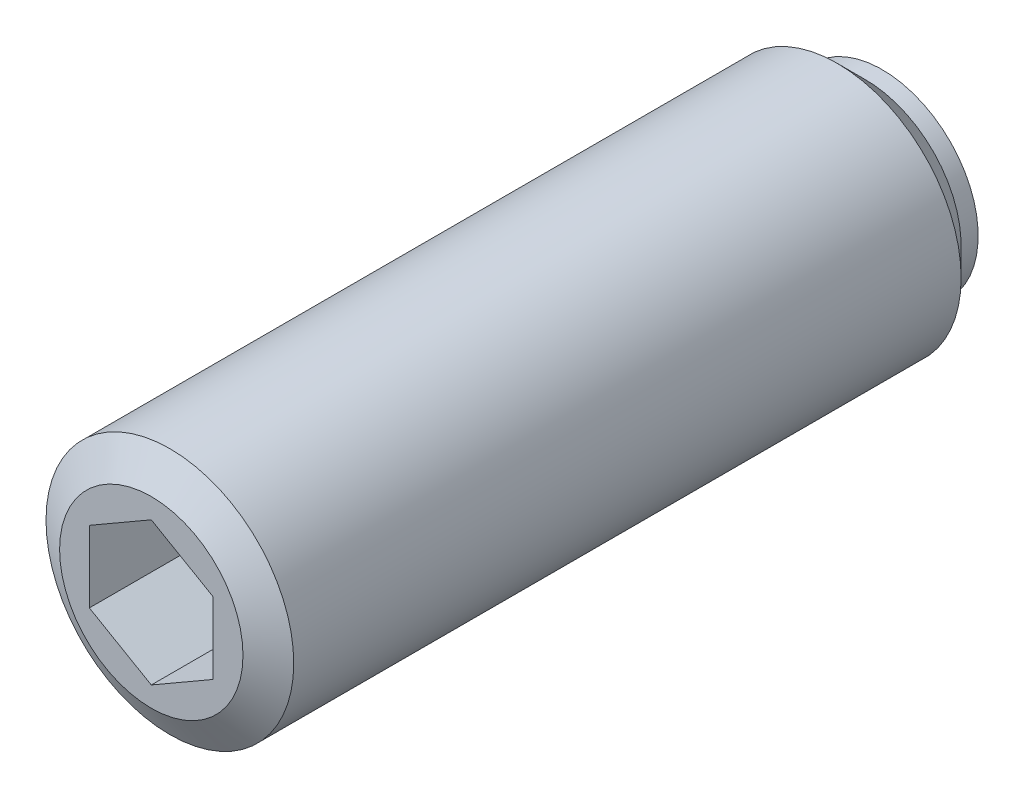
ISO-10303-21;
HEADER;
FILE_DESCRIPTION(('STEP AP214'),'2;1');
FILE_NAME('part.step','',(''),(''),'','','');
FILE_SCHEMA(('AUTOMOTIVE_DESIGN { 1 0 10303 214 1 1 1 1 }'));
ENDSEC;
DATA;
#1=APPLICATION_CONTEXT('core data for automotive mechanical design processes');
#2=APPLICATION_PROTOCOL_DEFINITION('international standard','automotive_design',2000,#1);
#3=PRODUCT_CONTEXT('',#1,'mechanical');
#4=PRODUCT('Part','Part','',(#3));
#5=PRODUCT_RELATED_PRODUCT_CATEGORY('part','',(#4));
#6=PRODUCT_DEFINITION_FORMATION('','',#4);
#7=PRODUCT_DEFINITION_CONTEXT('part definition',#1,'design');
#8=PRODUCT_DEFINITION('design','',#6,#7);
#9=PRODUCT_DEFINITION_SHAPE('','',#8);
#10=(LENGTH_UNIT() NAMED_UNIT(*) SI_UNIT(.MILLI.,.METRE.));
#11=(NAMED_UNIT(*) PLANE_ANGLE_UNIT() SI_UNIT($,.RADIAN.));
#12=(NAMED_UNIT(*) SI_UNIT($,.STERADIAN.) SOLID_ANGLE_UNIT());
#13=UNCERTAINTY_MEASURE_WITH_UNIT(LENGTH_MEASURE(1.E-05),#10,'distance_accuracy_value','');
#14=(GEOMETRIC_REPRESENTATION_CONTEXT(3) GLOBAL_UNCERTAINTY_ASSIGNED_CONTEXT((#13)) GLOBAL_UNIT_ASSIGNED_CONTEXT((#10,
#11,#12)) REPRESENTATION_CONTEXT('',''));
#15=CARTESIAN_POINT('',(0.,0.,0.));
#16=DIRECTION('',(0.,0.,1.));
#17=DIRECTION('',(1.,0.,0.));
#18=AXIS2_PLACEMENT_3D('',#15,#16,#17);
#19=CARTESIAN_POINT('',(0.,0.,2.75));
#20=DIRECTION('',(0.,0.,1.));
#21=DIRECTION('',(0.,-1.,0.));
#22=AXIS2_PLACEMENT_3D('',#19,#20,#21);
#23=SPHERICAL_SURFACE('',#22,2.75);
#24=CARTESIAN_POINT('',(0.,0.,1.4));
#25=DIRECTION('',(0.,0.,1.));
#26=DIRECTION('',(-1.,0.,0.));
#27=AXIS2_PLACEMENT_3D('',#24,#25,#26);
#28=CIRCLE('',#27,2.39582971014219);
#29=CARTESIAN_POINT('',(-2.39582971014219,0.,1.4));
#30=VERTEX_POINT('',#29);
#31=EDGE_CURVE('E9',#30,#30,#28,.T.);
#32=ORIENTED_EDGE('',*,*,#31,.F.);
#33=EDGE_LOOP('',(#32));
#34=FACE_BOUND('',#33,.T.);
#35=ADVANCED_FACE('F14',(#34),#23,.T.);
#36=CARTESIAN_POINT('',(0.,3.1,1.4));
#37=DIRECTION('',(0.,0.,1.));
#38=DIRECTION('',(-1.,0.,0.));
#39=AXIS2_PLACEMENT_3D('',#36,#37,#38);
#40=PLANE('',#39);
#41=CARTESIAN_POINT('',(0.,0.,1.4));
#42=DIRECTION('',(0.,0.,1.));
#43=DIRECTION('',(-1.,0.,0.));
#44=AXIS2_PLACEMENT_3D('',#41,#42,#43);
#45=CIRCLE('',#44,3.1);
#46=CARTESIAN_POINT('',(-3.1,0.,1.4));
#47=VERTEX_POINT('',#46);
#48=EDGE_CURVE('E21',#47,#47,#45,.T.);
#49=ORIENTED_EDGE('',*,*,#48,.F.);
#50=EDGE_LOOP('',(#49));
#51=FACE_BOUND('',#50,.T.);
#52=ORIENTED_EDGE('',*,*,#31,.T.);
#53=EDGE_LOOP('',(#52));
#54=FACE_BOUND('',#53,.T.);
#55=ADVANCED_FACE('F138',(#51,#54),#40,.F.);
#56=CARTESIAN_POINT('',(0.,0.,26.3950749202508));
#57=DIRECTION('',(0.,0.,1.));
#58=DIRECTION('',(-1.,0.,0.));
#59=AXIS2_PLACEMENT_3D('',#56,#57,#58);
#60=CYLINDRICAL_SURFACE('',#59,3.1);
#61=CARTESIAN_POINT('',(0.,0.,1.95));
#62=DIRECTION('',(0.,0.,1.));
#63=DIRECTION('',(-1.,0.,0.));
#64=AXIS2_PLACEMENT_3D('',#61,#62,#63);
#65=CIRCLE('',#64,3.1);
#66=CARTESIAN_POINT('',(-3.1,0.,1.95));
#67=VERTEX_POINT('',#66);
#68=EDGE_CURVE('E131',#67,#67,#65,.T.);
#69=ORIENTED_EDGE('',*,*,#68,.F.);
#70=EDGE_LOOP('',(#69));
#71=FACE_BOUND('',#70,.T.);
#72=ORIENTED_EDGE('',*,*,#48,.T.);
#73=EDGE_LOOP('',(#72));
#74=FACE_BOUND('',#73,.T.);
#75=ADVANCED_FACE('F136',(#71,#74),#60,.T.);
#76=CARTESIAN_POINT('',(0.,0.,1.95));
#77=DIRECTION('',(0.,0.,1.));
#78=DIRECTION('',(-1.,0.,0.));
#79=AXIS2_PLACEMENT_3D('',#76,#77,#78);
#80=CONICAL_SURFACE('',#79,3.1,0.785398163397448);
#81=CARTESIAN_POINT('',(0.,0.,2.85));
#82=DIRECTION('',(0.,0.,1.));
#83=DIRECTION('',(-1.,0.,0.));
#84=AXIS2_PLACEMENT_3D('',#81,#82,#83);
#85=CIRCLE('',#84,4.);
#86=CARTESIAN_POINT('',(-4.,0.,2.85));
#87=VERTEX_POINT('',#86);
#88=EDGE_CURVE('E128',#87,#87,#85,.T.);
#89=ORIENTED_EDGE('',*,*,#88,.F.);
#90=EDGE_LOOP('',(#89));
#91=FACE_BOUND('',#90,.T.);
#92=ORIENTED_EDGE('',*,*,#68,.T.);
#93=EDGE_LOOP('',(#92));
#94=FACE_BOUND('',#93,.T.);
#95=ADVANCED_FACE('F161',(#91,#94),#80,.T.);
#96=CARTESIAN_POINT('',(0.,0.,26.3950749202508));
#97=DIRECTION('',(0.,0.,1.));
#98=DIRECTION('',(-1.,0.,0.));
#99=AXIS2_PLACEMENT_3D('',#96,#97,#98);
#100=CYLINDRICAL_SURFACE('',#99,4.);
#101=CARTESIAN_POINT('',(0.,0.,24.4));
#102=DIRECTION('',(0.,0.,1.));
#103=DIRECTION('',(-1.,0.,0.));
#104=AXIS2_PLACEMENT_3D('',#101,#102,#103);
#105=CIRCLE('',#104,4.);
#106=CARTESIAN_POINT('',(-4.,0.,24.4));
#107=VERTEX_POINT('',#106);
#108=EDGE_CURVE('E125',#107,#107,#105,.T.);
#109=ORIENTED_EDGE('',*,*,#108,.F.);
#110=EDGE_LOOP('',(#109));
#111=FACE_BOUND('',#110,.T.);
#112=ORIENTED_EDGE('',*,*,#88,.T.);
#113=EDGE_LOOP('',(#112));
#114=FACE_BOUND('',#113,.T.);
#115=ADVANCED_FACE('F170',(#111,#114),#100,.T.);
#116=CARTESIAN_POINT('',(0.,0.,24.4));
#117=DIRECTION('',(0.,0.,-1.));
#118=DIRECTION('',(1.,0.,0.));
#119=AXIS2_PLACEMENT_3D('',#116,#117,#118);
#120=CONICAL_SURFACE('',#119,4.,1.04719755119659);
#121=CARTESIAN_POINT('',(0.,0.,25.));
#122=DIRECTION('',(0.,0.,1.));
#123=DIRECTION('',(-1.,0.,0.));
#124=AXIS2_PLACEMENT_3D('',#121,#122,#123);
#125=CIRCLE('',#124,2.9607695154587);
#126=CARTESIAN_POINT('',(-2.9607695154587,0.,25.));
#127=VERTEX_POINT('',#126);
#128=EDGE_CURVE('E116',#127,#127,#125,.T.);
#129=ORIENTED_EDGE('',*,*,#128,.F.);
#130=EDGE_LOOP('',(#129));
#131=FACE_BOUND('',#130,.T.);
#132=ORIENTED_EDGE('',*,*,#108,.T.);
#133=EDGE_LOOP('',(#132));
#134=FACE_BOUND('',#133,.T.);
#135=ADVANCED_FACE('F179',(#131,#134),#120,.T.);
#136=CARTESIAN_POINT('',(0.,0.,25.));
#137=DIRECTION('',(0.,0.,-1.));
#138=DIRECTION('',(1.,0.,0.));
#139=AXIS2_PLACEMENT_3D('',#136,#137,#138);
#140=PLANE('',#139);
#141=DIRECTION('',(-0.866025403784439,-0.5,0.));
#142=VECTOR('',#141,1.);
#143=CARTESIAN_POINT('',(0.,2.30940107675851,25.));
#144=LINE('',#143,#142);
#145=CARTESIAN_POINT('',(0.,2.30940107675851,25.));
#146=VERTEX_POINT('',#145);
#147=CARTESIAN_POINT('',(-2.,1.15470053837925,25.));
#148=VERTEX_POINT('',#147);
#149=EDGE_CURVE('E82',#146,#148,#144,.T.);
#150=ORIENTED_EDGE('',*,*,#149,.F.);
#151=DIRECTION('',(-0.866025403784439,0.5,0.));
#152=VECTOR('',#151,1.);
#153=CARTESIAN_POINT('',(2.,1.15470053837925,25.));
#154=LINE('',#153,#152);
#155=CARTESIAN_POINT('',(2.,1.15470053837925,25.));
#156=VERTEX_POINT('',#155);
#157=EDGE_CURVE('E28',#156,#146,#154,.T.);
#158=ORIENTED_EDGE('',*,*,#157,.F.);
#159=DIRECTION('',(0.,1.,0.));
#160=VECTOR('',#159,1.);
#161=CARTESIAN_POINT('',(2.,-1.15470053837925,25.));
#162=LINE('',#161,#160);
#163=CARTESIAN_POINT('',(2.,-1.15470053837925,25.));
#164=VERTEX_POINT('',#163);
#165=EDGE_CURVE('E98',#164,#156,#162,.T.);
#166=ORIENTED_EDGE('',*,*,#165,.F.);
#167=DIRECTION('',(0.866025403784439,0.5,0.));
#168=VECTOR('',#167,1.);
#169=CARTESIAN_POINT('',(0.,-2.30940107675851,25.));
#170=LINE('',#169,#168);
#171=CARTESIAN_POINT('',(0.,-2.30940107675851,25.));
#172=VERTEX_POINT('',#171);
#173=EDGE_CURVE('E92',#172,#164,#170,.T.);
#174=ORIENTED_EDGE('',*,*,#173,.F.);
#175=DIRECTION('',(0.866025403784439,-0.5,0.));
#176=VECTOR('',#175,1.);
#177=CARTESIAN_POINT('',(-2.,-1.15470053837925,25.));
#178=LINE('',#177,#176);
#179=CARTESIAN_POINT('',(-2.,-1.15470053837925,25.));
#180=VERTEX_POINT('',#179);
#181=EDGE_CURVE('E90',#180,#172,#178,.T.);
#182=ORIENTED_EDGE('',*,*,#181,.F.);
#183=DIRECTION('',(0.,-1.,0.));
#184=VECTOR('',#183,1.);
#185=CARTESIAN_POINT('',(-2.,1.15470053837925,25.));
#186=LINE('',#185,#184);
#187=EDGE_CURVE('E71',#148,#180,#186,.T.);
#188=ORIENTED_EDGE('',*,*,#187,.F.);
#189=EDGE_LOOP('',(#150,#158,#166,#174,#182,#188));
#190=FACE_BOUND('',#189,.T.);
#191=ORIENTED_EDGE('',*,*,#128,.T.);
#192=EDGE_LOOP('',(#191));
#193=FACE_BOUND('',#192,.T.);
#194=ADVANCED_FACE('F86',(#190,#193),#140,.F.);
#195=CARTESIAN_POINT('',(2.,1.15470053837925,21.));
#196=DIRECTION('',(0.5,0.866025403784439,0.));
#197=DIRECTION('',(0.866025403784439,-0.5,0.));
#198=AXIS2_PLACEMENT_3D('',#195,#196,#197);
#199=PLANE('',#198);
#200=ORIENTED_EDGE('',*,*,#157,.T.);
#201=DIRECTION('',(0.,0.,1.));
#202=VECTOR('',#201,1.);
#203=CARTESIAN_POINT('',(0.,2.30940107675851,21.));
#204=LINE('',#203,#202);
#205=CARTESIAN_POINT('',(0.,2.30940107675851,21.));
#206=VERTEX_POINT('',#205);
#207=EDGE_CURVE('E79',#206,#146,#204,.T.);
#208=ORIENTED_EDGE('',*,*,#207,.F.);
#209=DIRECTION('',(-0.866025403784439,0.5,0.));
#210=VECTOR('',#209,1.);
#211=CARTESIAN_POINT('',(2.,1.15470053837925,21.));
#212=LINE('',#211,#210);
#213=CARTESIAN_POINT('',(2.,1.15470053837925,21.));
#214=VERTEX_POINT('',#213);
#215=EDGE_CURVE('E100',#214,#206,#212,.T.);
#216=ORIENTED_EDGE('',*,*,#215,.F.);
#217=DIRECTION('',(0.,0.,1.));
#218=VECTOR('',#217,1.);
#219=CARTESIAN_POINT('',(2.,1.15470053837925,21.));
#220=LINE('',#219,#218);
#221=EDGE_CURVE('E35',#214,#156,#220,.T.);
#222=ORIENTED_EDGE('',*,*,#221,.T.);
#223=EDGE_LOOP('',(#200,#208,#216,#222));
#224=FACE_BOUND('',#223,.T.);
#225=ADVANCED_FACE('F196',(#224),#199,.F.);
#226=CARTESIAN_POINT('',(2.,-1.15470053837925,21.));
#227=DIRECTION('',(1.,0.,0.));
#228=DIRECTION('',(0.,0.,1.));
#229=AXIS2_PLACEMENT_3D('',#226,#227,#228);
#230=PLANE('',#229);
#231=ORIENTED_EDGE('',*,*,#165,.T.);
#232=ORIENTED_EDGE('',*,*,#221,.F.);
#233=DIRECTION('',(0.,1.,0.));
#234=VECTOR('',#233,1.);
#235=CARTESIAN_POINT('',(2.,-1.15470053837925,21.));
#236=LINE('',#235,#234);
#237=CARTESIAN_POINT('',(2.,-1.15470053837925,21.));
#238=VERTEX_POINT('',#237);
#239=EDGE_CURVE('E112',#238,#214,#236,.T.);
#240=ORIENTED_EDGE('',*,*,#239,.F.);
#241=DIRECTION('',(0.,0.,1.));
#242=VECTOR('',#241,1.);
#243=CARTESIAN_POINT('',(2.,-1.15470053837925,21.));
#244=LINE('',#243,#242);
#245=EDGE_CURVE('E117',#238,#164,#244,.T.);
#246=ORIENTED_EDGE('',*,*,#245,.T.);
#247=EDGE_LOOP('',(#231,#232,#240,#246));
#248=FACE_BOUND('',#247,.T.);
#249=ADVANCED_FACE('F204',(#248),#230,.F.);
#250=CARTESIAN_POINT('',(0.,-2.30940107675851,21.));
#251=DIRECTION('',(0.5,-0.866025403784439,0.));
#252=DIRECTION('',(-0.866025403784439,-0.5,0.));
#253=AXIS2_PLACEMENT_3D('',#250,#251,#252);
#254=PLANE('',#253);
#255=ORIENTED_EDGE('',*,*,#173,.T.);
#256=ORIENTED_EDGE('',*,*,#245,.F.);
#257=DIRECTION('',(0.866025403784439,0.5,0.));
#258=VECTOR('',#257,1.);
#259=CARTESIAN_POINT('',(0.,-2.30940107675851,21.));
#260=LINE('',#259,#258);
#261=CARTESIAN_POINT('',(0.,-2.30940107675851,21.));
#262=VERTEX_POINT('',#261);
#263=EDGE_CURVE('E109',#262,#238,#260,.T.);
#264=ORIENTED_EDGE('',*,*,#263,.F.);
#265=DIRECTION('',(0.,0.,1.));
#266=VECTOR('',#265,1.);
#267=CARTESIAN_POINT('',(0.,-2.30940107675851,21.));
#268=LINE('',#267,#266);
#269=EDGE_CURVE('E119',#262,#172,#268,.T.);
#270=ORIENTED_EDGE('',*,*,#269,.T.);
#271=EDGE_LOOP('',(#255,#256,#264,#270));
#272=FACE_BOUND('',#271,.T.);
#273=ADVANCED_FACE('F212',(#272),#254,.F.);
#274=CARTESIAN_POINT('',(-2.,-1.15470053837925,21.));
#275=DIRECTION('',(-0.5,-0.866025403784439,0.));
#276=DIRECTION('',(-0.866025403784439,0.5,0.));
#277=AXIS2_PLACEMENT_3D('',#274,#275,#276);
#278=PLANE('',#277);
#279=ORIENTED_EDGE('',*,*,#181,.T.);
#280=ORIENTED_EDGE('',*,*,#269,.F.);
#281=DIRECTION('',(0.866025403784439,-0.5,0.));
#282=VECTOR('',#281,1.);
#283=CARTESIAN_POINT('',(-2.,-1.15470053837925,21.));
#284=LINE('',#283,#282);
#285=CARTESIAN_POINT('',(-2.,-1.15470053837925,21.));
#286=VERTEX_POINT('',#285);
#287=EDGE_CURVE('E106',#286,#262,#284,.T.);
#288=ORIENTED_EDGE('',*,*,#287,.F.);
#289=DIRECTION('',(0.,0.,1.));
#290=VECTOR('',#289,1.);
#291=CARTESIAN_POINT('',(-2.,-1.15470053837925,21.));
#292=LINE('',#291,#290);
#293=EDGE_CURVE('E78',#286,#180,#292,.T.);
#294=ORIENTED_EDGE('',*,*,#293,.T.);
#295=EDGE_LOOP('',(#279,#280,#288,#294));
#296=FACE_BOUND('',#295,.T.);
#297=ADVANCED_FACE('F220',(#296),#278,.F.);
#298=CARTESIAN_POINT('',(-2.,1.15470053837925,21.));
#299=DIRECTION('',(-1.,0.,0.));
#300=DIRECTION('',(0.,1.,0.));
#301=AXIS2_PLACEMENT_3D('',#298,#299,#300);
#302=PLANE('',#301);
#303=ORIENTED_EDGE('',*,*,#187,.T.);
#304=ORIENTED_EDGE('',*,*,#293,.F.);
#305=DIRECTION('',(0.,-1.,0.));
#306=VECTOR('',#305,1.);
#307=CARTESIAN_POINT('',(-2.,1.15470053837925,21.));
#308=LINE('',#307,#306);
#309=CARTESIAN_POINT('',(-2.,1.15470053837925,21.));
#310=VERTEX_POINT('',#309);
#311=EDGE_CURVE('E74',#310,#286,#308,.T.);
#312=ORIENTED_EDGE('',*,*,#311,.F.);
#313=DIRECTION('',(0.,0.,1.));
#314=VECTOR('',#313,1.);
#315=CARTESIAN_POINT('',(-2.,1.15470053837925,21.));
#316=LINE('',#315,#314);
#317=EDGE_CURVE('E67',#310,#148,#316,.T.);
#318=ORIENTED_EDGE('',*,*,#317,.T.);
#319=EDGE_LOOP('',(#303,#304,#312,#318));
#320=FACE_BOUND('',#319,.T.);
#321=ADVANCED_FACE('F69',(#320),#302,.F.);
#322=CARTESIAN_POINT('',(0.,2.30940107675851,21.));
#323=DIRECTION('',(-0.5,0.866025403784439,0.));
#324=DIRECTION('',(0.866025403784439,0.5,0.));
#325=AXIS2_PLACEMENT_3D('',#322,#323,#324);
#326=PLANE('',#325);
#327=ORIENTED_EDGE('',*,*,#149,.T.);
#328=ORIENTED_EDGE('',*,*,#317,.F.);
#329=DIRECTION('',(-0.866025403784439,-0.5,0.));
#330=VECTOR('',#329,1.);
#331=CARTESIAN_POINT('',(0.,2.30940107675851,21.));
#332=LINE('',#331,#330);
#333=EDGE_CURVE('E103',#206,#310,#332,.T.);
#334=ORIENTED_EDGE('',*,*,#333,.F.);
#335=ORIENTED_EDGE('',*,*,#207,.T.);
#336=EDGE_LOOP('',(#327,#328,#334,#335));
#337=FACE_BOUND('',#336,.T.);
#338=ADVANCED_FACE('F83',(#337),#326,.F.);
#339=CARTESIAN_POINT('',(2.,1.15470053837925,21.));
#340=DIRECTION('',(0.,0.,-1.));
#341=DIRECTION('',(1.,0.,0.));
#342=AXIS2_PLACEMENT_3D('',#339,#340,#341);
#343=PLANE('',#342);
#344=ORIENTED_EDGE('',*,*,#215,.T.);
#345=ORIENTED_EDGE('',*,*,#333,.T.);
#346=ORIENTED_EDGE('',*,*,#311,.T.);
#347=ORIENTED_EDGE('',*,*,#287,.T.);
#348=ORIENTED_EDGE('',*,*,#263,.T.);
#349=ORIENTED_EDGE('',*,*,#239,.T.);
#350=EDGE_LOOP('',(#344,#345,#346,#347,#348,#349));
#351=FACE_BOUND('',#350,.T.);
#352=ADVANCED_FACE('F244',(#351),#343,.F.);
#353=CLOSED_SHELL('',(#35,#55,#75,#95,#115,#135,#194,#225,#249,#273,#297,#321,#338,#352));
#354=MANIFOLD_SOLID_BREP('B1',#353);
#355=ADVANCED_BREP_SHAPE_REPRESENTATION('',(#18,#354),#14);
#356=SHAPE_DEFINITION_REPRESENTATION(#9,#355);
ENDSEC;
END-ISO-10303-21;
